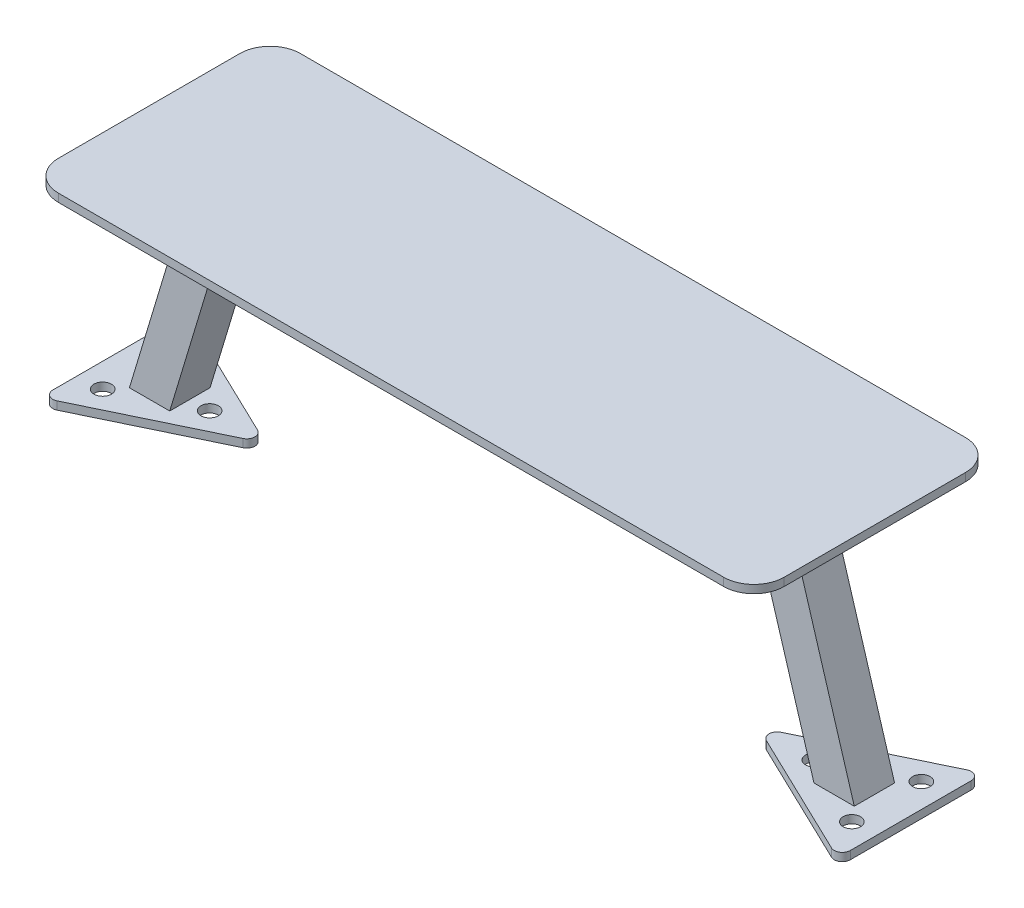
from build123d import *

# Parameters (mm, degrees)
SKETCH1_W             = 228.6
SKETCH1_H             = 76.2
BOSS_EXTRUDE1_DEPTH   = 2.54
FILLET1_R             = 9.525
SKETCH2_R             = 2.75
BOSS_EXTRUDE2_DEPTH   = 2.54
BOSS_EXTRUDE2_2_DEPTH = 2.54
FILLET3_R             = 2.54
FILLET5_R             = 2.54
BOSS_EXTRUDE3_DEPTH   = 6.35


with BuildPart() as part:
    # Sketch1 → Boss-Extrude1 (new body)
    with BuildSketch(Plane(origin=(0, 0, 0), x_dir=(1, 0, 0), z_dir=(0, 1, 0))):
        Rectangle(SKETCH1_W, SKETCH1_H)
    extrude(amount=BOSS_EXTRUDE1_DEPTH)

    # Fillet1
    fillet1_edges = [part.edges().sort_by_distance(p)[0] for p in [
        (114.3, 1.27, 38.1),
        (-114.3, 1.27, 38.1),
        (-114.3, 1.27, -38.1),
        (114.3, 1.27, -38.1),
    ]]
    fillet(fillet1_edges, radius=FILLET1_R)



with BuildPart() as body_2:
    # Sketch2 → Boss-Extrude2 (new body)
    with BuildSketch(Plane(origin=(0, -73.66, 0), x_dir=(1, 0, 0), z_dir=(0, 1, 0))):
        Polygon((125.62, 23.066963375), (77.673593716, 0), (125.62, -23.066963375), align=None)
        with Locations(Location((118, 10.945, 0), (0, 0, 270))):
            Circle(SKETCH2_R, mode=Mode.SUBTRACT)
        with Locations(Location((118, -10.945, 0), (0, 0, 270))):
            Circle(SKETCH2_R, mode=Mode.SUBTRACT)
        with Locations(Location((95.25, 0, 0), (0, 0, 270))):
            Circle(SKETCH2_R, mode=Mode.SUBTRACT)
    extrude(amount=BOSS_EXTRUDE2_DEPTH)

    # Fillet3
    fillet3_edges = [body_2.edges().sort_by_distance(p)[0] for p in [
        (125.62, -72.39, 23.066963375),
        (77.673593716, -72.39, 0),
        (125.62, -72.39, -23.066963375),
    ]]
    fillet(fillet3_edges, radius=FILLET3_R)


with BuildPart() as body_3:
    # Sketch2 → Boss-Extrude2 2 (new body)
    with BuildSketch(Plane(origin=(0, -73.66, 0), x_dir=(1, 0, 0), z_dir=(0, 1, 0))):
        Polygon((-125.62, -23.066963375), (-77.673593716, 0), (-125.62, 23.066963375), align=None)
        with Locations(Location((-118, -10.945, 0), (0, 0, 90))):
            Circle(SKETCH2_R, mode=Mode.SUBTRACT)
        with Locations(Location((-118, 10.945, 0), (0, 0, 90))):
            Circle(SKETCH2_R, mode=Mode.SUBTRACT)
        with Locations(Location((-95.25, 0, 0), (0, 0, 90))):
            Circle(SKETCH2_R, mode=Mode.SUBTRACT)
    extrude(amount=BOSS_EXTRUDE2_2_DEPTH)

    # Fillet5
    fillet5_edges = [body_3.edges().sort_by_distance(p)[0] for p in [
        (-77.673593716, -72.39, 0),
        (-125.62, -72.39, 23.066963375),
        (-125.62, -72.39, -23.066963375),
    ]]
    fillet(fillet5_edges, radius=FILLET5_R)


with BuildPart() as part_1:
    add(part.part)

    add(body_2.part)  # Boss-Extrude3 merges body 2
    # Sketch4 → Boss-Extrude3 (add, symmetric)
    with BuildSketch(Plane.XY):
        Polygon((92.712368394, 0), (114.170148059, -71.12), (101.470148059, -71.12), (80.012368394, 0), align=None)
    boss_extrude3 = extrude(amount=BOSS_EXTRUDE3_DEPTH, both=True)

    # Mirror1: Boss-Extrude3 across plane
    add(boss_extrude3.mirror(Plane(origin=(0, 0, 0), x_dir=(0, 0, 1), z_dir=(1, 0, 0))))


solid = Compound([body_3.part, part_1.part])
